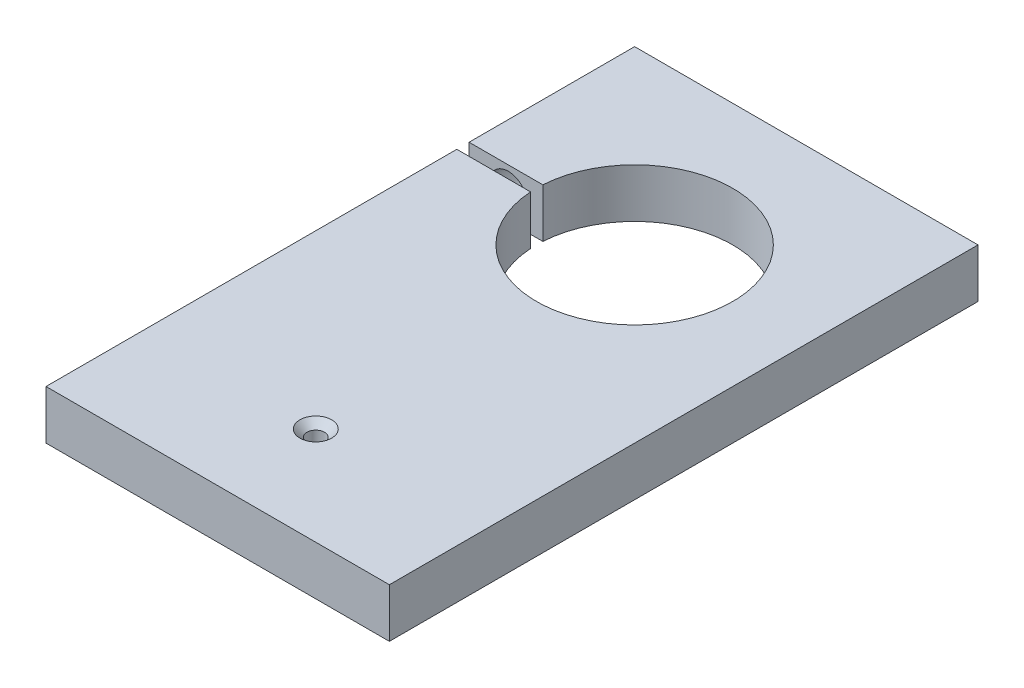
ISO-10303-21;
HEADER;
FILE_DESCRIPTION(('STEP AP214'),'2;1');
FILE_NAME('part.step','',(''),(''),'','','');
FILE_SCHEMA(('AUTOMOTIVE_DESIGN { 1 0 10303 214 1 1 1 1 }'));
ENDSEC;
DATA;
#1=APPLICATION_CONTEXT('core data for automotive mechanical design processes');
#2=APPLICATION_PROTOCOL_DEFINITION('international standard','automotive_design',2000,#1);
#3=PRODUCT_CONTEXT('',#1,'mechanical');
#4=PRODUCT('Part','Part','',(#3));
#5=PRODUCT_RELATED_PRODUCT_CATEGORY('part','',(#4));
#6=PRODUCT_DEFINITION_FORMATION('','',#4);
#7=PRODUCT_DEFINITION_CONTEXT('part definition',#1,'design');
#8=PRODUCT_DEFINITION('design','',#6,#7);
#9=PRODUCT_DEFINITION_SHAPE('','',#8);
#10=(LENGTH_UNIT() NAMED_UNIT(*) SI_UNIT(.MILLI.,.METRE.));
#11=(NAMED_UNIT(*) PLANE_ANGLE_UNIT() SI_UNIT($,.RADIAN.));
#12=(NAMED_UNIT(*) SI_UNIT($,.STERADIAN.) SOLID_ANGLE_UNIT());
#13=UNCERTAINTY_MEASURE_WITH_UNIT(LENGTH_MEASURE(1.E-05),#10,'distance_accuracy_value','');
#14=(GEOMETRIC_REPRESENTATION_CONTEXT(3) GLOBAL_UNCERTAINTY_ASSIGNED_CONTEXT((#13)) GLOBAL_UNIT_ASSIGNED_CONTEXT((#10,
#11,#12)) REPRESENTATION_CONTEXT('',''));
#15=CARTESIAN_POINT('',(0.,0.,0.));
#16=DIRECTION('',(0.,0.,1.));
#17=DIRECTION('',(1.,0.,0.));
#18=AXIS2_PLACEMENT_3D('',#15,#16,#17);
#19=CARTESIAN_POINT('',(0.,6.35,-15.875));
#20=DIRECTION('',(0.,-1.,0.));
#21=DIRECTION('',(0.,0.,-1.));
#22=AXIS2_PLACEMENT_3D('',#19,#20,#21);
#23=CYLINDRICAL_SURFACE('',#22,12.7);
#24=CARTESIAN_POINT('',(0.,0.,-15.875));
#25=DIRECTION('',(0.,1.,0.));
#26=DIRECTION('',(0.,0.,1.));
#27=AXIS2_PLACEMENT_3D('',#24,#25,#26);
#28=CIRCLE('',#27,12.7);
#29=CARTESIAN_POINT('',(-12.6751710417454,0.,-15.08125));
#30=VERTEX_POINT('',#29);
#31=CARTESIAN_POINT('',(-12.6751710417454,0.,-16.66875));
#32=VERTEX_POINT('',#31);
#33=EDGE_CURVE('E145',#30,#32,#28,.T.);
#34=ORIENTED_EDGE('',*,*,#33,.F.);
#35=DIRECTION('',(0.,-1.,0.));
#36=VECTOR('',#35,1.);
#37=CARTESIAN_POINT('',(-12.6751710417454,6.35,-15.08125));
#38=LINE('',#37,#36);
#39=CARTESIAN_POINT('',(-12.6751710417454,6.35,-15.08125));
#40=VERTEX_POINT('',#39);
#41=EDGE_CURVE('E13',#40,#30,#38,.T.);
#42=ORIENTED_EDGE('',*,*,#41,.F.);
#43=CARTESIAN_POINT('',(0.,6.35,-15.875));
#44=DIRECTION('',(0.,1.,0.));
#45=DIRECTION('',(0.,0.,1.));
#46=AXIS2_PLACEMENT_3D('',#43,#44,#45);
#47=CIRCLE('',#46,12.7);
#48=CARTESIAN_POINT('',(-12.6751710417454,6.35,-16.66875));
#49=VERTEX_POINT('',#48);
#50=EDGE_CURVE('E163',#40,#49,#47,.T.);
#51=ORIENTED_EDGE('',*,*,#50,.T.);
#52=DIRECTION('',(0.,-1.,0.));
#53=VECTOR('',#52,1.);
#54=CARTESIAN_POINT('',(-12.6751710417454,6.35,-16.66875));
#55=LINE('',#54,#53);
#56=EDGE_CURVE('E63',#49,#32,#55,.T.);
#57=ORIENTED_EDGE('',*,*,#56,.T.);
#58=EDGE_LOOP('',(#34,#42,#51,#57));
#59=FACE_BOUND('',#58,.T.);
#60=ADVANCED_FACE('F45',(#59),#23,.F.);
#61=CARTESIAN_POINT('',(-68.7581592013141,6.35,-15.08125));
#62=DIRECTION('',(0.,0.,1.));
#63=DIRECTION('',(1.,0.,0.));
#64=AXIS2_PLACEMENT_3D('',#61,#62,#63);
#65=PLANE('',#64);
#66=CARTESIAN_POINT('',(-17.145,3.175,-15.08125));
#67=DIRECTION('',(0.,0.,1.));
#68=DIRECTION('',(1.,0.,0.));
#69=AXIS2_PLACEMENT_3D('',#66,#67,#68);
#70=CIRCLE('',#69,1.72719999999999);
#71=CARTESIAN_POINT('',(-15.4178,3.175,-15.08125));
#72=VERTEX_POINT('',#71);
#73=EDGE_CURVE('E48',#72,#72,#70,.T.);
#74=ORIENTED_EDGE('',*,*,#73,.T.);
#75=EDGE_LOOP('',(#74));
#76=FACE_BOUND('',#75,.T.);
#77=DIRECTION('',(-1.,0.,0.));
#78=VECTOR('',#77,1.);
#79=CARTESIAN_POINT('',(-68.7581592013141,0.,-15.08125));
#80=LINE('',#79,#78);
#81=CARTESIAN_POINT('',(-22.225,0.,-15.08125));
#82=VERTEX_POINT('',#81);
#83=EDGE_CURVE('E147',#30,#82,#80,.T.);
#84=ORIENTED_EDGE('',*,*,#83,.T.);
#85=DIRECTION('',(0.,-1.,0.));
#86=VECTOR('',#85,1.);
#87=CARTESIAN_POINT('',(-22.225,6.35,-15.08125));
#88=LINE('',#87,#86);
#89=CARTESIAN_POINT('',(-22.225,6.35,-15.08125));
#90=VERTEX_POINT('',#89);
#91=EDGE_CURVE('E54',#90,#82,#88,.T.);
#92=ORIENTED_EDGE('',*,*,#91,.F.);
#93=DIRECTION('',(-1.,0.,0.));
#94=VECTOR('',#93,1.);
#95=CARTESIAN_POINT('',(-68.7581592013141,6.35,-15.08125));
#96=LINE('',#95,#94);
#97=EDGE_CURVE('E187',#40,#90,#96,.T.);
#98=ORIENTED_EDGE('',*,*,#97,.F.);
#99=ORIENTED_EDGE('',*,*,#41,.T.);
#100=EDGE_LOOP('',(#84,#92,#98,#99));
#101=FACE_BOUND('',#100,.T.);
#102=ADVANCED_FACE('F215',(#76,#101),#65,.F.);
#103=CARTESIAN_POINT('',(-22.225,6.35,0.));
#104=DIRECTION('',(1.,0.,0.));
#105=DIRECTION('',(0.,0.,-1.));
#106=AXIS2_PLACEMENT_3D('',#103,#104,#105);
#107=PLANE('',#106);
#108=DIRECTION('',(0.,0.,1.));
#109=VECTOR('',#108,1.);
#110=CARTESIAN_POINT('',(-22.225,0.,0.));
#111=LINE('',#110,#109);
#112=CARTESIAN_POINT('',(-22.225,0.,38.1));
#113=VERTEX_POINT('',#112);
#114=EDGE_CURVE('E150',#82,#113,#111,.T.);
#115=ORIENTED_EDGE('',*,*,#114,.T.);
#116=DIRECTION('',(0.,-1.,0.));
#117=VECTOR('',#116,1.);
#118=CARTESIAN_POINT('',(-22.225,6.35,38.1));
#119=LINE('',#118,#117);
#120=CARTESIAN_POINT('',(-22.225,6.35,38.1));
#121=VERTEX_POINT('',#120);
#122=EDGE_CURVE('E169',#121,#113,#119,.T.);
#123=ORIENTED_EDGE('',*,*,#122,.F.);
#124=DIRECTION('',(0.,0.,1.));
#125=VECTOR('',#124,1.);
#126=CARTESIAN_POINT('',(-22.225,6.35,0.));
#127=LINE('',#126,#125);
#128=EDGE_CURVE('E133',#90,#121,#127,.T.);
#129=ORIENTED_EDGE('',*,*,#128,.F.);
#130=ORIENTED_EDGE('',*,*,#91,.T.);
#131=EDGE_LOOP('',(#115,#123,#129,#130));
#132=FACE_BOUND('',#131,.T.);
#133=ADVANCED_FACE('F212',(#132),#107,.F.);
#134=CARTESIAN_POINT('',(-68.7581592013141,6.35,38.1));
#135=DIRECTION('',(0.,0.,-1.));
#136=DIRECTION('',(-1.,0.,0.));
#137=AXIS2_PLACEMENT_3D('',#134,#135,#136);
#138=PLANE('',#137);
#139=DIRECTION('',(1.,0.,0.));
#140=VECTOR('',#139,1.);
#141=CARTESIAN_POINT('',(-68.7581592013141,0.,38.1));
#142=LINE('',#141,#140);
#143=CARTESIAN_POINT('',(22.225,0.,38.1));
#144=VERTEX_POINT('',#143);
#145=EDGE_CURVE('E152',#113,#144,#142,.T.);
#146=ORIENTED_EDGE('',*,*,#145,.T.);
#147=DIRECTION('',(0.,-1.,0.));
#148=VECTOR('',#147,1.);
#149=CARTESIAN_POINT('',(22.225,6.35,38.1));
#150=LINE('',#149,#148);
#151=CARTESIAN_POINT('',(22.225,6.35,38.1));
#152=VERTEX_POINT('',#151);
#153=EDGE_CURVE('E167',#152,#144,#150,.T.);
#154=ORIENTED_EDGE('',*,*,#153,.F.);
#155=DIRECTION('',(1.,0.,0.));
#156=VECTOR('',#155,1.);
#157=CARTESIAN_POINT('',(-68.7581592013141,6.35,38.1));
#158=LINE('',#157,#156);
#159=EDGE_CURVE('E140',#121,#152,#158,.T.);
#160=ORIENTED_EDGE('',*,*,#159,.F.);
#161=ORIENTED_EDGE('',*,*,#122,.T.);
#162=EDGE_LOOP('',(#146,#154,#160,#161));
#163=FACE_BOUND('',#162,.T.);
#164=ADVANCED_FACE('F193',(#163),#138,.F.);
#165=CARTESIAN_POINT('',(22.225,6.35,0.));
#166=DIRECTION('',(1.,0.,0.));
#167=DIRECTION('',(0.,0.,-1.));
#168=AXIS2_PLACEMENT_3D('',#165,#166,#167);
#169=PLANE('',#168);
#170=DIRECTION('',(0.,0.,1.));
#171=VECTOR('',#170,1.);
#172=CARTESIAN_POINT('',(22.225,0.,0.));
#173=LINE('',#172,#171);
#174=CARTESIAN_POINT('',(22.225,0.,-38.1));
#175=VERTEX_POINT('',#174);
#176=EDGE_CURVE('E156',#175,#144,#173,.T.);
#177=ORIENTED_EDGE('',*,*,#176,.F.);
#178=DIRECTION('',(0.,-1.,0.));
#179=VECTOR('',#178,1.);
#180=CARTESIAN_POINT('',(22.225,6.35,-38.1));
#181=LINE('',#180,#179);
#182=CARTESIAN_POINT('',(22.225,6.35,-38.1));
#183=VERTEX_POINT('',#182);
#184=EDGE_CURVE('E125',#183,#175,#181,.T.);
#185=ORIENTED_EDGE('',*,*,#184,.F.);
#186=DIRECTION('',(0.,0.,1.));
#187=VECTOR('',#186,1.);
#188=CARTESIAN_POINT('',(22.225,6.35,0.));
#189=LINE('',#188,#187);
#190=EDGE_CURVE('E138',#183,#152,#189,.T.);
#191=ORIENTED_EDGE('',*,*,#190,.T.);
#192=ORIENTED_EDGE('',*,*,#153,.T.);
#193=EDGE_LOOP('',(#177,#185,#191,#192));
#194=FACE_BOUND('',#193,.T.);
#195=ADVANCED_FACE('F197',(#194),#169,.T.);
#196=CARTESIAN_POINT('',(-68.7581592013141,6.35,-38.1));
#197=DIRECTION('',(0.,0.,-1.));
#198=DIRECTION('',(-1.,0.,0.));
#199=AXIS2_PLACEMENT_3D('',#196,#197,#198);
#200=PLANE('',#199);
#201=CARTESIAN_POINT('',(-17.145,3.175,-38.1));
#202=DIRECTION('',(0.,0.,-1.));
#203=DIRECTION('',(-1.,0.,0.));
#204=AXIS2_PLACEMENT_3D('',#201,#202,#203);
#205=CIRCLE('',#204,2.45745);
#206=CARTESIAN_POINT('',(-19.60245,3.175,-38.1));
#207=VERTEX_POINT('',#206);
#208=EDGE_CURVE('E174',#207,#207,#205,.T.);
#209=ORIENTED_EDGE('',*,*,#208,.F.);
#210=EDGE_LOOP('',(#209));
#211=FACE_BOUND('',#210,.T.);
#212=DIRECTION('',(1.,0.,0.));
#213=VECTOR('',#212,1.);
#214=CARTESIAN_POINT('',(-68.7581592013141,0.,-38.1));
#215=LINE('',#214,#213);
#216=CARTESIAN_POINT('',(-22.225,0.,-38.1));
#217=VERTEX_POINT('',#216);
#218=EDGE_CURVE('E122',#217,#175,#215,.T.);
#219=ORIENTED_EDGE('',*,*,#218,.F.);
#220=DIRECTION('',(0.,-1.,0.));
#221=VECTOR('',#220,1.);
#222=CARTESIAN_POINT('',(-22.225,6.35,-38.1));
#223=LINE('',#222,#221);
#224=CARTESIAN_POINT('',(-22.225,6.35,-38.1));
#225=VERTEX_POINT('',#224);
#226=EDGE_CURVE('E116',#225,#217,#223,.T.);
#227=ORIENTED_EDGE('',*,*,#226,.F.);
#228=DIRECTION('',(1.,0.,0.));
#229=VECTOR('',#228,1.);
#230=CARTESIAN_POINT('',(-68.7581592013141,6.35,-38.1));
#231=LINE('',#230,#229);
#232=EDGE_CURVE('E120',#225,#183,#231,.T.);
#233=ORIENTED_EDGE('',*,*,#232,.T.);
#234=ORIENTED_EDGE('',*,*,#184,.T.);
#235=EDGE_LOOP('',(#219,#227,#233,#234));
#236=FACE_BOUND('',#235,.T.);
#237=ADVANCED_FACE('F118',(#211,#236),#200,.T.);
#238=CARTESIAN_POINT('',(-22.225,0.,-16.66875));
#239=VERTEX_POINT('',#238);
#240=EDGE_CURVE('E153',#217,#239,#111,.T.);
#241=ORIENTED_EDGE('',*,*,#240,.T.);
#242=DIRECTION('',(0.,-1.,0.));
#243=VECTOR('',#242,1.);
#244=CARTESIAN_POINT('',(-22.225,6.35,-16.66875));
#245=LINE('',#244,#243);
#246=CARTESIAN_POINT('',(-22.225,6.35,-16.66875));
#247=VERTEX_POINT('',#246);
#248=EDGE_CURVE('E90',#247,#239,#245,.T.);
#249=ORIENTED_EDGE('',*,*,#248,.F.);
#250=EDGE_CURVE('E127',#225,#247,#127,.T.);
#251=ORIENTED_EDGE('',*,*,#250,.F.);
#252=ORIENTED_EDGE('',*,*,#226,.T.);
#253=EDGE_LOOP('',(#241,#249,#251,#252));
#254=FACE_BOUND('',#253,.T.);
#255=ADVANCED_FACE('F128',(#254),#107,.F.);
#256=CARTESIAN_POINT('',(-68.7581592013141,6.35,-16.66875));
#257=DIRECTION('',(0.,0.,1.));
#258=DIRECTION('',(1.,0.,0.));
#259=AXIS2_PLACEMENT_3D('',#256,#257,#258);
#260=PLANE('',#259);
#261=CARTESIAN_POINT('',(-17.145,3.175,-16.66875));
#262=DIRECTION('',(0.,0.,1.));
#263=DIRECTION('',(1.,0.,0.));
#264=AXIS2_PLACEMENT_3D('',#261,#262,#263);
#265=CIRCLE('',#264,2.45745);
#266=CARTESIAN_POINT('',(-14.68755,3.175,-16.66875));
#267=VERTEX_POINT('',#266);
#268=EDGE_CURVE('E148',#267,#267,#265,.T.);
#269=ORIENTED_EDGE('',*,*,#268,.F.);
#270=EDGE_LOOP('',(#269));
#271=FACE_BOUND('',#270,.T.);
#272=DIRECTION('',(-1.,0.,0.));
#273=VECTOR('',#272,1.);
#274=CARTESIAN_POINT('',(-68.7581592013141,0.,-16.66875));
#275=LINE('',#274,#273);
#276=EDGE_CURVE('E160',#32,#239,#275,.T.);
#277=ORIENTED_EDGE('',*,*,#276,.F.);
#278=ORIENTED_EDGE('',*,*,#56,.F.);
#279=DIRECTION('',(-1.,0.,0.));
#280=VECTOR('',#279,1.);
#281=CARTESIAN_POINT('',(-68.7581592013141,6.35,-16.66875));
#282=LINE('',#281,#280);
#283=EDGE_CURVE('E131',#49,#247,#282,.T.);
#284=ORIENTED_EDGE('',*,*,#283,.T.);
#285=ORIENTED_EDGE('',*,*,#248,.T.);
#286=EDGE_LOOP('',(#277,#278,#284,#285));
#287=FACE_BOUND('',#286,.T.);
#288=ADVANCED_FACE('F201',(#271,#287),#260,.T.);
#289=CARTESIAN_POINT('',(-68.7581592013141,6.35,0.));
#290=DIRECTION('',(0.,1.,0.));
#291=DIRECTION('',(0.,0.,1.));
#292=AXIS2_PLACEMENT_3D('',#289,#290,#291);
#293=PLANE('',#292);
#294=CARTESIAN_POINT('',(0.,6.35,25.4));
#295=DIRECTION('',(0.,1.,0.));
#296=DIRECTION('',(0.,0.,1.));
#297=AXIS2_PLACEMENT_3D('',#294,#295,#296);
#298=CIRCLE('',#297,2.0574);
#299=CARTESIAN_POINT('',(0.,6.35,27.4574));
#300=VERTEX_POINT('',#299);
#301=EDGE_CURVE('E338',#300,#300,#298,.T.);
#302=ORIENTED_EDGE('',*,*,#301,.F.);
#303=EDGE_LOOP('',(#302));
#304=FACE_BOUND('',#303,.T.);
#305=ORIENTED_EDGE('',*,*,#50,.F.);
#306=ORIENTED_EDGE('',*,*,#97,.T.);
#307=ORIENTED_EDGE('',*,*,#128,.T.);
#308=ORIENTED_EDGE('',*,*,#159,.T.);
#309=ORIENTED_EDGE('',*,*,#190,.F.);
#310=ORIENTED_EDGE('',*,*,#232,.F.);
#311=ORIENTED_EDGE('',*,*,#250,.T.);
#312=ORIENTED_EDGE('',*,*,#283,.F.);
#313=EDGE_LOOP('',(#305,#306,#307,#308,#309,#310,#311,#312));
#314=FACE_BOUND('',#313,.T.);
#315=ADVANCED_FACE('F136',(#304,#314),#293,.T.);
#316=CARTESIAN_POINT('',(-68.7581592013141,0.,0.));
#317=DIRECTION('',(0.,1.,0.));
#318=DIRECTION('',(0.,0.,1.));
#319=AXIS2_PLACEMENT_3D('',#316,#317,#318);
#320=PLANE('',#319);
#321=CARTESIAN_POINT('',(0.,0.,25.4));
#322=DIRECTION('',(0.,1.,0.));
#323=DIRECTION('',(0.,0.,1.));
#324=AXIS2_PLACEMENT_3D('',#321,#322,#323);
#325=CIRCLE('',#324,1.1303);
#326=CARTESIAN_POINT('',(0.,0.,26.5303));
#327=VERTEX_POINT('',#326);
#328=EDGE_CURVE('E340',#327,#327,#325,.T.);
#329=ORIENTED_EDGE('',*,*,#328,.T.);
#330=EDGE_LOOP('',(#329));
#331=FACE_BOUND('',#330,.T.);
#332=ORIENTED_EDGE('',*,*,#33,.T.);
#333=ORIENTED_EDGE('',*,*,#276,.T.);
#334=ORIENTED_EDGE('',*,*,#240,.F.);
#335=ORIENTED_EDGE('',*,*,#218,.T.);
#336=ORIENTED_EDGE('',*,*,#176,.T.);
#337=ORIENTED_EDGE('',*,*,#145,.F.);
#338=ORIENTED_EDGE('',*,*,#114,.F.);
#339=ORIENTED_EDGE('',*,*,#83,.F.);
#340=EDGE_LOOP('',(#332,#333,#334,#335,#336,#337,#338,#339));
#341=FACE_BOUND('',#340,.T.);
#342=ADVANCED_FACE('F199',(#331,#341),#320,.F.);
#343=CARTESIAN_POINT('',(-17.145,3.175,-38.1));
#344=DIRECTION('',(0.,0.,-1.));
#345=DIRECTION('',(-1.,0.,0.));
#346=AXIS2_PLACEMENT_3D('',#343,#344,#345);
#347=CYLINDRICAL_SURFACE('',#346,2.45745);
#348=ORIENTED_EDGE('',*,*,#268,.T.);
#349=EDGE_LOOP('',(#348));
#350=FACE_BOUND('',#349,.T.);
#351=ORIENTED_EDGE('',*,*,#208,.T.);
#352=EDGE_LOOP('',(#351));
#353=FACE_BOUND('',#352,.T.);
#354=ADVANCED_FACE('F271',(#350,#353),#347,.F.);
#355=CARTESIAN_POINT('',(-17.145,3.175,-38.1));
#356=DIRECTION('',(0.,0.,-1.));
#357=DIRECTION('',(-1.,0.,0.));
#358=AXIS2_PLACEMENT_3D('',#355,#356,#357);
#359=CYLINDRICAL_SURFACE('',#358,1.72719999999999);
#360=CARTESIAN_POINT('',(-17.145,3.175,-3.65760000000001));
#361=DIRECTION('',(0.,0.,-1.));
#362=DIRECTION('',(-1.,0.,0.));
#363=AXIS2_PLACEMENT_3D('',#360,#361,#362);
#364=CIRCLE('',#363,1.72719999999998);
#365=CARTESIAN_POINT('',(-18.8722,3.175,-3.65760000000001));
#366=VERTEX_POINT('',#365);
#367=EDGE_CURVE('E182',#366,#366,#364,.T.);
#368=ORIENTED_EDGE('',*,*,#367,.F.);
#369=EDGE_LOOP('',(#368));
#370=FACE_BOUND('',#369,.T.);
#371=ORIENTED_EDGE('',*,*,#73,.F.);
#372=EDGE_LOOP('',(#371));
#373=FACE_BOUND('',#372,.T.);
#374=ADVANCED_FACE('F275',(#370,#373),#359,.F.);
#375=CARTESIAN_POINT('',(-17.145,3.175,-3.65760000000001));
#376=DIRECTION('',(0.,0.,-1.));
#377=DIRECTION('',(-1.,0.,0.));
#378=AXIS2_PLACEMENT_3D('',#375,#376,#377);
#379=CONICAL_SURFACE('',#378,1.72719999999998,1.02974425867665);
#380=CARTESIAN_POINT('',(-17.145,3.175,-2.61979353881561));
#381=VERTEX_POINT('',#380);
#382=VERTEX_LOOP('',#381);
#383=FACE_BOUND('',#382,.T.);
#384=ORIENTED_EDGE('',*,*,#367,.T.);
#385=EDGE_LOOP('',(#384));
#386=FACE_BOUND('',#385,.T.);
#387=ADVANCED_FACE('F281',(#383,#386),#379,.F.);
#388=CARTESIAN_POINT('',(0.,6.35,25.4));
#389=DIRECTION('',(0.,1.,0.));
#390=DIRECTION('',(0.,0.,1.));
#391=AXIS2_PLACEMENT_3D('',#388,#389,#390);
#392=CYLINDRICAL_SURFACE('',#391,1.1303);
#393=ORIENTED_EDGE('',*,*,#328,.F.);
#394=EDGE_LOOP('',(#393));
#395=FACE_BOUND('',#394,.T.);
#396=CARTESIAN_POINT('',(0.,5.4229,25.4));
#397=DIRECTION('',(0.,1.,0.));
#398=DIRECTION('',(0.,0.,1.));
#399=AXIS2_PLACEMENT_3D('',#396,#397,#398);
#400=CIRCLE('',#399,1.1303);
#401=CARTESIAN_POINT('',(0.,5.4229,26.5303));
#402=VERTEX_POINT('',#401);
#403=EDGE_CURVE('E335',#402,#402,#400,.T.);
#404=ORIENTED_EDGE('',*,*,#403,.T.);
#405=EDGE_LOOP('',(#404));
#406=FACE_BOUND('',#405,.T.);
#407=ADVANCED_FACE('F291',(#395,#406),#392,.F.);
#408=CARTESIAN_POINT('',(0.,6.35,25.4));
#409=DIRECTION('',(0.,1.,0.));
#410=DIRECTION('',(0.,0.,1.));
#411=AXIS2_PLACEMENT_3D('',#408,#409,#410);
#412=CONICAL_SURFACE('',#411,2.0574,0.785398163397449);
#413=ORIENTED_EDGE('',*,*,#403,.F.);
#414=EDGE_LOOP('',(#413));
#415=FACE_BOUND('',#414,.T.);
#416=ORIENTED_EDGE('',*,*,#301,.T.);
#417=EDGE_LOOP('',(#416));
#418=FACE_BOUND('',#417,.T.);
#419=ADVANCED_FACE('F315',(#415,#418),#412,.F.);
#420=CLOSED_SHELL('',(#60,#102,#133,#164,#195,#237,#255,#288,#315,#342,#354,#374,#387,#407,#419));
#421=MANIFOLD_SOLID_BREP('B2',#420);
#422=ADVANCED_BREP_SHAPE_REPRESENTATION('',(#18,#421),#14);
#423=SHAPE_DEFINITION_REPRESENTATION(#9,#422);
ENDSEC;
END-ISO-10303-21;
